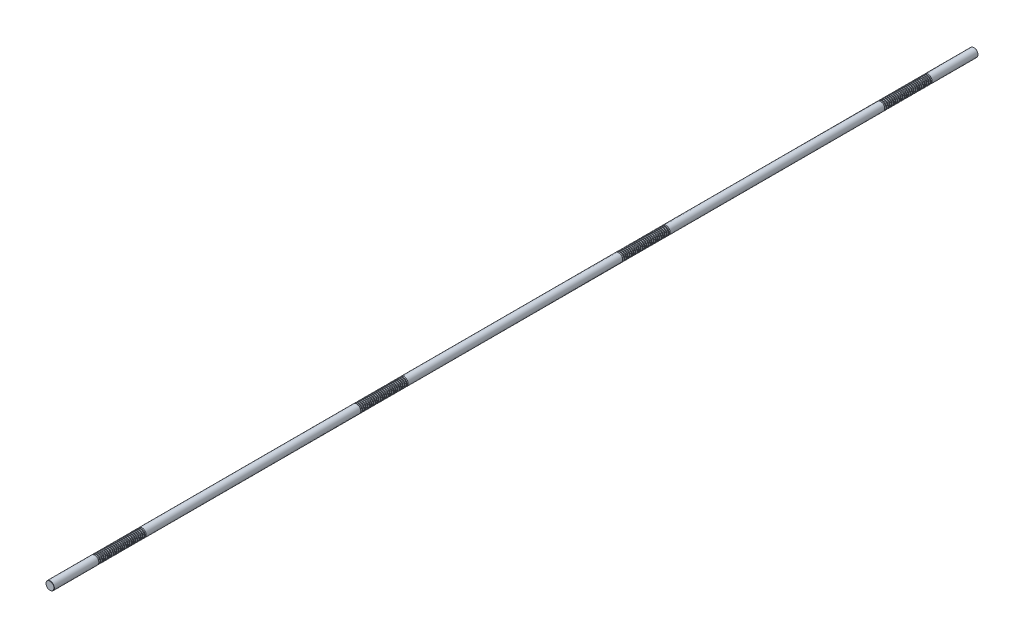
from build123d import *

# Parameters (mm, degrees)
SKETCH1_R           = 9
BOSS_EXTRUDE1_DEPTH = 1000
CHAMFER1_SIZE       = 0.45
LPATTERN1_COUNT     = 26
LPATTERN1_PITCH     = 4
LPATTERN2_COUNT     = 4
LPATTERN2_PITCH     = 567


with BuildPart() as part:
    # Sketch1 → Boss-Extrude1 (new, symmetric)
    with BuildSketch(Plane.XY):
        Circle(SKETCH1_R)
    extrude(amount=BOSS_EXTRUDE1_DEPTH, both=True)

    # Chamfer1
    chamfer1_edges = [part.edges().sort_by_distance(p)[0] for p in [
        (-9, 0, -1000),
        (-9, 0, 1000),
    ]]
    chamfer(chamfer1_edges, length=CHAMFER1_SIZE)

    # Sketch2 → Cut-Revolve1 (revolve, cut)
    with BuildSketch(Plane(origin=(0, 0, 0), x_dir=(0, 0, -1), z_dir=(1, 0, 0)), mode=Mode.PRIVATE) as cut_revolve1_sk:
        Polygon((900.301442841, 9), (897.698557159, 9), (898.301442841, 6.75), (899.698557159, 6.75), align=None)
    cut_revolve1 = revolve(cut_revolve1_sk.sketch.rotate(Axis((0, 0, 1000), (0, 0, -1)), 90), axis=Axis((0, 0, 1000), (0, 0, -1)), mode=Mode.SUBTRACT)

    # LPattern1: Cut-Revolve1 ×26
    with Locations(*[(0, 0, i * LPATTERN1_PITCH) for i in range(1, LPATTERN1_COUNT)]):
        add(cut_revolve1, mode=Mode.SUBTRACT)

    # LPattern2: Cut-Revolve1 ×4
    with Locations(*[(0, 0, i * LPATTERN2_PITCH) for i in range(1, LPATTERN2_COUNT)]):
        add(cut_revolve1, mode=Mode.SUBTRACT)

    # LPattern2 copy 1 sketch → LPattern2 copy 1 (revolve, cut)
    with BuildSketch(Plane(origin=(0, 0, 571), x_dir=(0, 0, -1), z_dir=(1, 0, 0))):
        Polygon((900.301442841, 9), (897.698557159, 9), (898.301442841, 6.75), (899.698557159, 6.75), align=None)
    revolve(axis=Axis((0, 0, 1571), (0, 0, -1)), mode=Mode.SUBTRACT)

    # LPattern2 copy 2 sketch → LPattern2 copy 2 (revolve, cut)
    with BuildSketch(Plane(origin=(0, 0, 1138), x_dir=(0, 0, -1), z_dir=(1, 0, 0))):
        Polygon((900.301442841, 9), (897.698557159, 9), (898.301442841, 6.75), (899.698557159, 6.75), align=None)
    revolve(axis=Axis((0, 0, 2138), (0, 0, -1)), mode=Mode.SUBTRACT)

    # LPattern2 copy 3 sketch → LPattern2 copy 3 (revolve, cut)
    with BuildSketch(Plane(origin=(0, 0, 1705), x_dir=(0, 0, -1), z_dir=(1, 0, 0))):
        Polygon((900.301442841, 9), (897.698557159, 9), (898.301442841, 6.75), (899.698557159, 6.75), align=None)
    revolve(axis=Axis((0, 0, 2705), (0, 0, -1)), mode=Mode.SUBTRACT)

    # LPattern2 copy 4 sketch → LPattern2 copy 4 (revolve, cut)
    with BuildSketch(Plane(origin=(0, 0, 575), x_dir=(0, 0, -1), z_dir=(1, 0, 0))):
        Polygon((900.301442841, 9), (897.698557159, 9), (898.301442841, 6.75), (899.698557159, 6.75), align=None)
    revolve(axis=Axis((0, 0, 1575), (0, 0, -1)), mode=Mode.SUBTRACT)

    # LPattern2 copy 5 sketch → LPattern2 copy 5 (revolve, cut)
    with BuildSketch(Plane(origin=(0, 0, 1142), x_dir=(0, 0, -1), z_dir=(1, 0, 0))):
        Polygon((900.301442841, 9), (897.698557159, 9), (898.301442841, 6.75), (899.698557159, 6.75), align=None)
    revolve(axis=Axis((0, 0, 2142), (0, 0, -1)), mode=Mode.SUBTRACT)

    # LPattern2 copy 6 sketch → LPattern2 copy 6 (revolve, cut)
    with BuildSketch(Plane(origin=(0, 0, 1709), x_dir=(0, 0, -1), z_dir=(1, 0, 0))):
        Polygon((900.301442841, 9), (897.698557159, 9), (898.301442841, 6.75), (899.698557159, 6.75), align=None)
    revolve(axis=Axis((0, 0, 2709), (0, 0, -1)), mode=Mode.SUBTRACT)

    # LPattern2 copy 7 sketch → LPattern2 copy 7 (revolve, cut)
    with BuildSketch(Plane(origin=(0, 0, 579), x_dir=(0, 0, -1), z_dir=(1, 0, 0))):
        Polygon((900.301442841, 9), (897.698557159, 9), (898.301442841, 6.75), (899.698557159, 6.75), align=None)
    revolve(axis=Axis((0, 0, 1579), (0, 0, -1)), mode=Mode.SUBTRACT)

    # LPattern2 copy 8 sketch → LPattern2 copy 8 (revolve, cut)
    with BuildSketch(Plane(origin=(0, 0, 1146), x_dir=(0, 0, -1), z_dir=(1, 0, 0))):
        Polygon((900.301442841, 9), (897.698557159, 9), (898.301442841, 6.75), (899.698557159, 6.75), align=None)
    revolve(axis=Axis((0, 0, 2146), (0, 0, -1)), mode=Mode.SUBTRACT)

    # LPattern2 copy 9 sketch → LPattern2 copy 9 (revolve, cut)
    with BuildSketch(Plane(origin=(0, 0, 1713), x_dir=(0, 0, -1), z_dir=(1, 0, 0))):
        Polygon((900.301442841, 9), (897.698557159, 9), (898.301442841, 6.75), (899.698557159, 6.75), align=None)
    revolve(axis=Axis((0, 0, 2713), (0, 0, -1)), mode=Mode.SUBTRACT)

    # LPattern2 copy 10 sketch → LPattern2 copy 10 (revolve, cut)
    with BuildSketch(Plane(origin=(0, 0, 583), x_dir=(0, 0, -1), z_dir=(1, 0, 0))):
        Polygon((900.301442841, 9), (897.698557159, 9), (898.301442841, 6.75), (899.698557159, 6.75), align=None)
    revolve(axis=Axis((0, 0, 1583), (0, 0, -1)), mode=Mode.SUBTRACT)

    # LPattern2 copy 11 sketch → LPattern2 copy 11 (revolve, cut)
    with BuildSketch(Plane(origin=(0, 0, 1150), x_dir=(0, 0, -1), z_dir=(1, 0, 0))):
        Polygon((900.301442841, 9), (897.698557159, 9), (898.301442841, 6.75), (899.698557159, 6.75), align=None)
    revolve(axis=Axis((0, 0, 2150), (0, 0, -1)), mode=Mode.SUBTRACT)

    # LPattern2 copy 12 sketch → LPattern2 copy 12 (revolve, cut)
    with BuildSketch(Plane(origin=(0, 0, 1717), x_dir=(0, 0, -1), z_dir=(1, 0, 0))):
        Polygon((900.301442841, 9), (897.698557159, 9), (898.301442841, 6.75), (899.698557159, 6.75), align=None)
    revolve(axis=Axis((0, 0, 2717), (0, 0, -1)), mode=Mode.SUBTRACT)

    # LPattern2 copy 13 sketch → LPattern2 copy 13 (revolve, cut)
    with BuildSketch(Plane(origin=(0, 0, 587), x_dir=(0, 0, -1), z_dir=(1, 0, 0))):
        Polygon((900.301442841, 9), (897.698557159, 9), (898.301442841, 6.75), (899.698557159, 6.75), align=None)
    revolve(axis=Axis((0, 0, 1587), (0, 0, -1)), mode=Mode.SUBTRACT)

    # LPattern2 copy 14 sketch → LPattern2 copy 14 (revolve, cut)
    with BuildSketch(Plane(origin=(0, 0, 1154), x_dir=(0, 0, -1), z_dir=(1, 0, 0))):
        Polygon((900.301442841, 9), (897.698557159, 9), (898.301442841, 6.75), (899.698557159, 6.75), align=None)
    revolve(axis=Axis((0, 0, 2154), (0, 0, -1)), mode=Mode.SUBTRACT)

    # LPattern2 copy 15 sketch → LPattern2 copy 15 (revolve, cut)
    with BuildSketch(Plane(origin=(0, 0, 1721), x_dir=(0, 0, -1), z_dir=(1, 0, 0))):
        Polygon((900.301442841, 9), (897.698557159, 9), (898.301442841, 6.75), (899.698557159, 6.75), align=None)
    revolve(axis=Axis((0, 0, 2721), (0, 0, -1)), mode=Mode.SUBTRACT)

    # LPattern2 copy 16 sketch → LPattern2 copy 16 (revolve, cut)
    with BuildSketch(Plane(origin=(0, 0, 591), x_dir=(0, 0, -1), z_dir=(1, 0, 0))):
        Polygon((900.301442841, 9), (897.698557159, 9), (898.301442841, 6.75), (899.698557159, 6.75), align=None)
    revolve(axis=Axis((0, 0, 1591), (0, 0, -1)), mode=Mode.SUBTRACT)

    # LPattern2 copy 17 sketch → LPattern2 copy 17 (revolve, cut)
    with BuildSketch(Plane(origin=(0, 0, 1158), x_dir=(0, 0, -1), z_dir=(1, 0, 0))):
        Polygon((900.301442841, 9), (897.698557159, 9), (898.301442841, 6.75), (899.698557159, 6.75), align=None)
    revolve(axis=Axis((0, 0, 2158), (0, 0, -1)), mode=Mode.SUBTRACT)

    # LPattern2 copy 18 sketch → LPattern2 copy 18 (revolve, cut)
    with BuildSketch(Plane(origin=(0, 0, 1725), x_dir=(0, 0, -1), z_dir=(1, 0, 0))):
        Polygon((900.301442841, 9), (897.698557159, 9), (898.301442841, 6.75), (899.698557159, 6.75), align=None)
    revolve(axis=Axis((0, 0, 2725), (0, 0, -1)), mode=Mode.SUBTRACT)

    # LPattern2 copy 19 sketch → LPattern2 copy 19 (revolve, cut)
    with BuildSketch(Plane(origin=(0, 0, 595), x_dir=(0, 0, -1), z_dir=(1, 0, 0))):
        Polygon((900.301442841, 9), (897.698557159, 9), (898.301442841, 6.75), (899.698557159, 6.75), align=None)
    revolve(axis=Axis((0, 0, 1595), (0, 0, -1)), mode=Mode.SUBTRACT)

    # LPattern2 copy 20 sketch → LPattern2 copy 20 (revolve, cut)
    with BuildSketch(Plane(origin=(0, 0, 1162), x_dir=(0, 0, -1), z_dir=(1, 0, 0))):
        Polygon((900.301442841, 9), (897.698557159, 9), (898.301442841, 6.75), (899.698557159, 6.75), align=None)
    revolve(axis=Axis((0, 0, 2162), (0, 0, -1)), mode=Mode.SUBTRACT)

    # LPattern2 copy 21 sketch → LPattern2 copy 21 (revolve, cut)
    with BuildSketch(Plane(origin=(0, 0, 1729), x_dir=(0, 0, -1), z_dir=(1, 0, 0))):
        Polygon((900.301442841, 9), (897.698557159, 9), (898.301442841, 6.75), (899.698557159, 6.75), align=None)
    revolve(axis=Axis((0, 0, 2729), (0, 0, -1)), mode=Mode.SUBTRACT)

    # LPattern2 copy 22 sketch → LPattern2 copy 22 (revolve, cut)
    with BuildSketch(Plane(origin=(0, 0, 599), x_dir=(0, 0, -1), z_dir=(1, 0, 0))):
        Polygon((900.301442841, 9), (897.698557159, 9), (898.301442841, 6.75), (899.698557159, 6.75), align=None)
    revolve(axis=Axis((0, 0, 1599), (0, 0, -1)), mode=Mode.SUBTRACT)

    # LPattern2 copy 23 sketch → LPattern2 copy 23 (revolve, cut)
    with BuildSketch(Plane(origin=(0, 0, 1166), x_dir=(0, 0, -1), z_dir=(1, 0, 0))):
        Polygon((900.301442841, 9), (897.698557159, 9), (898.301442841, 6.75), (899.698557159, 6.75), align=None)
    revolve(axis=Axis((0, 0, 2166), (0, 0, -1)), mode=Mode.SUBTRACT)

    # LPattern2 copy 24 sketch → LPattern2 copy 24 (revolve, cut)
    with BuildSketch(Plane(origin=(0, 0, 1733), x_dir=(0, 0, -1), z_dir=(1, 0, 0))):
        Polygon((900.301442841, 9), (897.698557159, 9), (898.301442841, 6.75), (899.698557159, 6.75), align=None)
    revolve(axis=Axis((0, 0, 2733), (0, 0, -1)), mode=Mode.SUBTRACT)

    # LPattern2 copy 25 sketch → LPattern2 copy 25 (revolve, cut)
    with BuildSketch(Plane(origin=(0, 0, 603), x_dir=(0, 0, -1), z_dir=(1, 0, 0))):
        Polygon((900.301442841, 9), (897.698557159, 9), (898.301442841, 6.75), (899.698557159, 6.75), align=None)
    revolve(axis=Axis((0, 0, 1603), (0, 0, -1)), mode=Mode.SUBTRACT)

    # LPattern2 copy 26 sketch → LPattern2 copy 26 (revolve, cut)
    with BuildSketch(Plane(origin=(0, 0, 1170), x_dir=(0, 0, -1), z_dir=(1, 0, 0))):
        Polygon((900.301442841, 9), (897.698557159, 9), (898.301442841, 6.75), (899.698557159, 6.75), align=None)
    revolve(axis=Axis((0, 0, 2170), (0, 0, -1)), mode=Mode.SUBTRACT)

    # LPattern2 copy 27 sketch → LPattern2 copy 27 (revolve, cut)
    with BuildSketch(Plane(origin=(0, 0, 1737), x_dir=(0, 0, -1), z_dir=(1, 0, 0))):
        Polygon((900.301442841, 9), (897.698557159, 9), (898.301442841, 6.75), (899.698557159, 6.75), align=None)
    revolve(axis=Axis((0, 0, 2737), (0, 0, -1)), mode=Mode.SUBTRACT)

    # LPattern2 copy 28 sketch → LPattern2 copy 28 (revolve, cut)
    with BuildSketch(Plane(origin=(0, 0, 607), x_dir=(0, 0, -1), z_dir=(1, 0, 0))):
        Polygon((900.301442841, 9), (897.698557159, 9), (898.301442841, 6.75), (899.698557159, 6.75), align=None)
    revolve(axis=Axis((0, 0, 1607), (0, 0, -1)), mode=Mode.SUBTRACT)

    # LPattern2 copy 29 sketch → LPattern2 copy 29 (revolve, cut)
    with BuildSketch(Plane(origin=(0, 0, 1174), x_dir=(0, 0, -1), z_dir=(1, 0, 0))):
        Polygon((900.301442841, 9), (897.698557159, 9), (898.301442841, 6.75), (899.698557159, 6.75), align=None)
    revolve(axis=Axis((0, 0, 2174), (0, 0, -1)), mode=Mode.SUBTRACT)

    # LPattern2 copy 30 sketch → LPattern2 copy 30 (revolve, cut)
    with BuildSketch(Plane(origin=(0, 0, 1741), x_dir=(0, 0, -1), z_dir=(1, 0, 0))):
        Polygon((900.301442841, 9), (897.698557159, 9), (898.301442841, 6.75), (899.698557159, 6.75), align=None)
    revolve(axis=Axis((0, 0, 2741), (0, 0, -1)), mode=Mode.SUBTRACT)

    # LPattern2 copy 31 sketch → LPattern2 copy 31 (revolve, cut)
    with BuildSketch(Plane(origin=(0, 0, 611), x_dir=(0, 0, -1), z_dir=(1, 0, 0))):
        Polygon((900.301442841, 9), (897.698557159, 9), (898.301442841, 6.75), (899.698557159, 6.75), align=None)
    revolve(axis=Axis((0, 0, 1611), (0, 0, -1)), mode=Mode.SUBTRACT)

    # LPattern2 copy 32 sketch → LPattern2 copy 32 (revolve, cut)
    with BuildSketch(Plane(origin=(0, 0, 1178), x_dir=(0, 0, -1), z_dir=(1, 0, 0))):
        Polygon((900.301442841, 9), (897.698557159, 9), (898.301442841, 6.75), (899.698557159, 6.75), align=None)
    revolve(axis=Axis((0, 0, 2178), (0, 0, -1)), mode=Mode.SUBTRACT)

    # LPattern2 copy 33 sketch → LPattern2 copy 33 (revolve, cut)
    with BuildSketch(Plane(origin=(0, 0, 1745), x_dir=(0, 0, -1), z_dir=(1, 0, 0))):
        Polygon((900.301442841, 9), (897.698557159, 9), (898.301442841, 6.75), (899.698557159, 6.75), align=None)
    revolve(axis=Axis((0, 0, 2745), (0, 0, -1)), mode=Mode.SUBTRACT)

    # LPattern2 copy 34 sketch → LPattern2 copy 34 (revolve, cut)
    with BuildSketch(Plane(origin=(0, 0, 615), x_dir=(0, 0, -1), z_dir=(1, 0, 0))):
        Polygon((900.301442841, 9), (897.698557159, 9), (898.301442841, 6.75), (899.698557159, 6.75), align=None)
    revolve(axis=Axis((0, 0, 1615), (0, 0, -1)), mode=Mode.SUBTRACT)

    # LPattern2 copy 35 sketch → LPattern2 copy 35 (revolve, cut)
    with BuildSketch(Plane(origin=(0, 0, 1182), x_dir=(0, 0, -1), z_dir=(1, 0, 0))):
        Polygon((900.301442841, 9), (897.698557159, 9), (898.301442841, 6.75), (899.698557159, 6.75), align=None)
    revolve(axis=Axis((0, 0, 2182), (0, 0, -1)), mode=Mode.SUBTRACT)

    # LPattern2 copy 36 sketch → LPattern2 copy 36 (revolve, cut)
    with BuildSketch(Plane(origin=(0, 0, 1749), x_dir=(0, 0, -1), z_dir=(1, 0, 0))):
        Polygon((900.301442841, 9), (897.698557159, 9), (898.301442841, 6.75), (899.698557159, 6.75), align=None)
    revolve(axis=Axis((0, 0, 2749), (0, 0, -1)), mode=Mode.SUBTRACT)

    # LPattern2 copy 37 sketch → LPattern2 copy 37 (revolve, cut)
    with BuildSketch(Plane(origin=(0, 0, 619), x_dir=(0, 0, -1), z_dir=(1, 0, 0))):
        Polygon((900.301442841, 9), (897.698557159, 9), (898.301442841, 6.75), (899.698557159, 6.75), align=None)
    revolve(axis=Axis((0, 0, 1619), (0, 0, -1)), mode=Mode.SUBTRACT)

    # LPattern2 copy 38 sketch → LPattern2 copy 38 (revolve, cut)
    with BuildSketch(Plane(origin=(0, 0, 1186), x_dir=(0, 0, -1), z_dir=(1, 0, 0))):
        Polygon((900.301442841, 9), (897.698557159, 9), (898.301442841, 6.75), (899.698557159, 6.75), align=None)
    revolve(axis=Axis((0, 0, 2186), (0, 0, -1)), mode=Mode.SUBTRACT)

    # LPattern2 copy 39 sketch → LPattern2 copy 39 (revolve, cut)
    with BuildSketch(Plane(origin=(0, 0, 1753), x_dir=(0, 0, -1), z_dir=(1, 0, 0))):
        Polygon((900.301442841, 9), (897.698557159, 9), (898.301442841, 6.75), (899.698557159, 6.75), align=None)
    revolve(axis=Axis((0, 0, 2753), (0, 0, -1)), mode=Mode.SUBTRACT)

    # LPattern2 copy 40 sketch → LPattern2 copy 40 (revolve, cut)
    with BuildSketch(Plane(origin=(0, 0, 623), x_dir=(0, 0, -1), z_dir=(1, 0, 0))):
        Polygon((900.301442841, 9), (897.698557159, 9), (898.301442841, 6.75), (899.698557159, 6.75), align=None)
    revolve(axis=Axis((0, 0, 1623), (0, 0, -1)), mode=Mode.SUBTRACT)

    # LPattern2 copy 41 sketch → LPattern2 copy 41 (revolve, cut)
    with BuildSketch(Plane(origin=(0, 0, 1190), x_dir=(0, 0, -1), z_dir=(1, 0, 0))):
        Polygon((900.301442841, 9), (897.698557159, 9), (898.301442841, 6.75), (899.698557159, 6.75), align=None)
    revolve(axis=Axis((0, 0, 2190), (0, 0, -1)), mode=Mode.SUBTRACT)

    # LPattern2 copy 42 sketch → LPattern2 copy 42 (revolve, cut)
    with BuildSketch(Plane(origin=(0, 0, 1757), x_dir=(0, 0, -1), z_dir=(1, 0, 0))):
        Polygon((900.301442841, 9), (897.698557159, 9), (898.301442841, 6.75), (899.698557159, 6.75), align=None)
    revolve(axis=Axis((0, 0, 2757), (0, 0, -1)), mode=Mode.SUBTRACT)

    # LPattern2 copy 43 sketch → LPattern2 copy 43 (revolve, cut)
    with BuildSketch(Plane(origin=(0, 0, 627), x_dir=(0, 0, -1), z_dir=(1, 0, 0))):
        Polygon((900.301442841, 9), (897.698557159, 9), (898.301442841, 6.75), (899.698557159, 6.75), align=None)
    revolve(axis=Axis((0, 0, 1627), (0, 0, -1)), mode=Mode.SUBTRACT)

    # LPattern2 copy 44 sketch → LPattern2 copy 44 (revolve, cut)
    with BuildSketch(Plane(origin=(0, 0, 1194), x_dir=(0, 0, -1), z_dir=(1, 0, 0))):
        Polygon((900.301442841, 9), (897.698557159, 9), (898.301442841, 6.75), (899.698557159, 6.75), align=None)
    revolve(axis=Axis((0, 0, 2194), (0, 0, -1)), mode=Mode.SUBTRACT)

    # LPattern2 copy 45 sketch → LPattern2 copy 45 (revolve, cut)
    with BuildSketch(Plane(origin=(0, 0, 1761), x_dir=(0, 0, -1), z_dir=(1, 0, 0))):
        Polygon((900.301442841, 9), (897.698557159, 9), (898.301442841, 6.75), (899.698557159, 6.75), align=None)
    revolve(axis=Axis((0, 0, 2761), (0, 0, -1)), mode=Mode.SUBTRACT)

    # LPattern2 copy 46 sketch → LPattern2 copy 46 (revolve, cut)
    with BuildSketch(Plane(origin=(0, 0, 631), x_dir=(0, 0, -1), z_dir=(1, 0, 0))):
        Polygon((900.301442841, 9), (897.698557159, 9), (898.301442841, 6.75), (899.698557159, 6.75), align=None)
    revolve(axis=Axis((0, 0, 1631), (0, 0, -1)), mode=Mode.SUBTRACT)

    # LPattern2 copy 47 sketch → LPattern2 copy 47 (revolve, cut)
    with BuildSketch(Plane(origin=(0, 0, 1198), x_dir=(0, 0, -1), z_dir=(1, 0, 0))):
        Polygon((900.301442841, 9), (897.698557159, 9), (898.301442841, 6.75), (899.698557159, 6.75), align=None)
    revolve(axis=Axis((0, 0, 2198), (0, 0, -1)), mode=Mode.SUBTRACT)

    # LPattern2 copy 48 sketch → LPattern2 copy 48 (revolve, cut)
    with BuildSketch(Plane(origin=(0, 0, 1765), x_dir=(0, 0, -1), z_dir=(1, 0, 0))):
        Polygon((900.301442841, 9), (897.698557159, 9), (898.301442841, 6.75), (899.698557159, 6.75), align=None)
    revolve(axis=Axis((0, 0, 2765), (0, 0, -1)), mode=Mode.SUBTRACT)

    # LPattern2 copy 49 sketch → LPattern2 copy 49 (revolve, cut)
    with BuildSketch(Plane(origin=(0, 0, 635), x_dir=(0, 0, -1), z_dir=(1, 0, 0))):
        Polygon((900.301442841, 9), (897.698557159, 9), (898.301442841, 6.75), (899.698557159, 6.75), align=None)
    revolve(axis=Axis((0, 0, 1635), (0, 0, -1)), mode=Mode.SUBTRACT)

    # LPattern2 copy 50 sketch → LPattern2 copy 50 (revolve, cut)
    with BuildSketch(Plane(origin=(0, 0, 1202), x_dir=(0, 0, -1), z_dir=(1, 0, 0))):
        Polygon((900.301442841, 9), (897.698557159, 9), (898.301442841, 6.75), (899.698557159, 6.75), align=None)
    revolve(axis=Axis((0, 0, 2202), (0, 0, -1)), mode=Mode.SUBTRACT)

    # LPattern2 copy 51 sketch → LPattern2 copy 51 (revolve, cut)
    with BuildSketch(Plane(origin=(0, 0, 1769), x_dir=(0, 0, -1), z_dir=(1, 0, 0))):
        Polygon((900.301442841, 9), (897.698557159, 9), (898.301442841, 6.75), (899.698557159, 6.75), align=None)
    revolve(axis=Axis((0, 0, 2769), (0, 0, -1)), mode=Mode.SUBTRACT)

    # LPattern2 copy 52 sketch → LPattern2 copy 52 (revolve, cut)
    with BuildSketch(Plane(origin=(0, 0, 639), x_dir=(0, 0, -1), z_dir=(1, 0, 0))):
        Polygon((900.301442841, 9), (897.698557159, 9), (898.301442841, 6.75), (899.698557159, 6.75), align=None)
    revolve(axis=Axis((0, 0, 1639), (0, 0, -1)), mode=Mode.SUBTRACT)

    # LPattern2 copy 53 sketch → LPattern2 copy 53 (revolve, cut)
    with BuildSketch(Plane(origin=(0, 0, 1206), x_dir=(0, 0, -1), z_dir=(1, 0, 0))):
        Polygon((900.301442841, 9), (897.698557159, 9), (898.301442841, 6.75), (899.698557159, 6.75), align=None)
    revolve(axis=Axis((0, 0, 2206), (0, 0, -1)), mode=Mode.SUBTRACT)

    # LPattern2 copy 54 sketch → LPattern2 copy 54 (revolve, cut)
    with BuildSketch(Plane(origin=(0, 0, 1773), x_dir=(0, 0, -1), z_dir=(1, 0, 0))):
        Polygon((900.301442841, 9), (897.698557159, 9), (898.301442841, 6.75), (899.698557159, 6.75), align=None)
    revolve(axis=Axis((0, 0, 2773), (0, 0, -1)), mode=Mode.SUBTRACT)

    # LPattern2 copy 55 sketch → LPattern2 copy 55 (revolve, cut)
    with BuildSketch(Plane(origin=(0, 0, 643), x_dir=(0, 0, -1), z_dir=(1, 0, 0))):
        Polygon((900.301442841, 9), (897.698557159, 9), (898.301442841, 6.75), (899.698557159, 6.75), align=None)
    revolve(axis=Axis((0, 0, 1643), (0, 0, -1)), mode=Mode.SUBTRACT)

    # LPattern2 copy 56 sketch → LPattern2 copy 56 (revolve, cut)
    with BuildSketch(Plane(origin=(0, 0, 1210), x_dir=(0, 0, -1), z_dir=(1, 0, 0))):
        Polygon((900.301442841, 9), (897.698557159, 9), (898.301442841, 6.75), (899.698557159, 6.75), align=None)
    revolve(axis=Axis((0, 0, 2210), (0, 0, -1)), mode=Mode.SUBTRACT)

    # LPattern2 copy 57 sketch → LPattern2 copy 57 (revolve, cut)
    with BuildSketch(Plane(origin=(0, 0, 1777), x_dir=(0, 0, -1), z_dir=(1, 0, 0))):
        Polygon((900.301442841, 9), (897.698557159, 9), (898.301442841, 6.75), (899.698557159, 6.75), align=None)
    revolve(axis=Axis((0, 0, 2777), (0, 0, -1)), mode=Mode.SUBTRACT)

    # LPattern2 copy 58 sketch → LPattern2 copy 58 (revolve, cut)
    with BuildSketch(Plane(origin=(0, 0, 647), x_dir=(0, 0, -1), z_dir=(1, 0, 0))):
        Polygon((900.301442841, 9), (897.698557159, 9), (898.301442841, 6.75), (899.698557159, 6.75), align=None)
    revolve(axis=Axis((0, 0, 1647), (0, 0, -1)), mode=Mode.SUBTRACT)

    # LPattern2 copy 59 sketch → LPattern2 copy 59 (revolve, cut)
    with BuildSketch(Plane(origin=(0, 0, 1214), x_dir=(0, 0, -1), z_dir=(1, 0, 0))):
        Polygon((900.301442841, 9), (897.698557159, 9), (898.301442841, 6.75), (899.698557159, 6.75), align=None)
    revolve(axis=Axis((0, 0, 2214), (0, 0, -1)), mode=Mode.SUBTRACT)

    # LPattern2 copy 60 sketch → LPattern2 copy 60 (revolve, cut)
    with BuildSketch(Plane(origin=(0, 0, 1781), x_dir=(0, 0, -1), z_dir=(1, 0, 0))):
        Polygon((900.301442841, 9), (897.698557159, 9), (898.301442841, 6.75), (899.698557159, 6.75), align=None)
    revolve(axis=Axis((0, 0, 2781), (0, 0, -1)), mode=Mode.SUBTRACT)

    # LPattern2 copy 61 sketch → LPattern2 copy 61 (revolve, cut)
    with BuildSketch(Plane(origin=(0, 0, 651), x_dir=(0, 0, -1), z_dir=(1, 0, 0))):
        Polygon((900.301442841, 9), (897.698557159, 9), (898.301442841, 6.75), (899.698557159, 6.75), align=None)
    revolve(axis=Axis((0, 0, 1651), (0, 0, -1)), mode=Mode.SUBTRACT)

    # LPattern2 copy 62 sketch → LPattern2 copy 62 (revolve, cut)
    with BuildSketch(Plane(origin=(0, 0, 1218), x_dir=(0, 0, -1), z_dir=(1, 0, 0))):
        Polygon((900.301442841, 9), (897.698557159, 9), (898.301442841, 6.75), (899.698557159, 6.75), align=None)
    revolve(axis=Axis((0, 0, 2218), (0, 0, -1)), mode=Mode.SUBTRACT)

    # LPattern2 copy 63 sketch → LPattern2 copy 63 (revolve, cut)
    with BuildSketch(Plane(origin=(0, 0, 1785), x_dir=(0, 0, -1), z_dir=(1, 0, 0))):
        Polygon((900.301442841, 9), (897.698557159, 9), (898.301442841, 6.75), (899.698557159, 6.75), align=None)
    revolve(axis=Axis((0, 0, 2785), (0, 0, -1)), mode=Mode.SUBTRACT)

    # LPattern2 copy 64 sketch → LPattern2 copy 64 (revolve, cut)
    with BuildSketch(Plane(origin=(0, 0, 655), x_dir=(0, 0, -1), z_dir=(1, 0, 0))):
        Polygon((900.301442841, 9), (897.698557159, 9), (898.301442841, 6.75), (899.698557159, 6.75), align=None)
    revolve(axis=Axis((0, 0, 1655), (0, 0, -1)), mode=Mode.SUBTRACT)

    # LPattern2 copy 65 sketch → LPattern2 copy 65 (revolve, cut)
    with BuildSketch(Plane(origin=(0, 0, 1222), x_dir=(0, 0, -1), z_dir=(1, 0, 0))):
        Polygon((900.301442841, 9), (897.698557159, 9), (898.301442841, 6.75), (899.698557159, 6.75), align=None)
    revolve(axis=Axis((0, 0, 2222), (0, 0, -1)), mode=Mode.SUBTRACT)

    # LPattern2 copy 66 sketch → LPattern2 copy 66 (revolve, cut)
    with BuildSketch(Plane(origin=(0, 0, 1789), x_dir=(0, 0, -1), z_dir=(1, 0, 0))):
        Polygon((900.301442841, 9), (897.698557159, 9), (898.301442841, 6.75), (899.698557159, 6.75), align=None)
    revolve(axis=Axis((0, 0, 2789), (0, 0, -1)), mode=Mode.SUBTRACT)

    # LPattern2 copy 67 sketch → LPattern2 copy 67 (revolve, cut)
    with BuildSketch(Plane(origin=(0, 0, 659), x_dir=(0, 0, -1), z_dir=(1, 0, 0))):
        Polygon((900.301442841, 9), (897.698557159, 9), (898.301442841, 6.75), (899.698557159, 6.75), align=None)
    revolve(axis=Axis((0, 0, 1659), (0, 0, -1)), mode=Mode.SUBTRACT)

    # LPattern2 copy 68 sketch → LPattern2 copy 68 (revolve, cut)
    with BuildSketch(Plane(origin=(0, 0, 1226), x_dir=(0, 0, -1), z_dir=(1, 0, 0))):
        Polygon((900.301442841, 9), (897.698557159, 9), (898.301442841, 6.75), (899.698557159, 6.75), align=None)
    revolve(axis=Axis((0, 0, 2226), (0, 0, -1)), mode=Mode.SUBTRACT)

    # LPattern2 copy 69 sketch → LPattern2 copy 69 (revolve, cut)
    with BuildSketch(Plane(origin=(0, 0, 1793), x_dir=(0, 0, -1), z_dir=(1, 0, 0))):
        Polygon((900.301442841, 9), (897.698557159, 9), (898.301442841, 6.75), (899.698557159, 6.75), align=None)
    revolve(axis=Axis((0, 0, 2793), (0, 0, -1)), mode=Mode.SUBTRACT)

    # LPattern2 copy 70 sketch → LPattern2 copy 70 (revolve, cut)
    with BuildSketch(Plane(origin=(0, 0, 663), x_dir=(0, 0, -1), z_dir=(1, 0, 0))):
        Polygon((900.301442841, 9), (897.698557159, 9), (898.301442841, 6.75), (899.698557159, 6.75), align=None)
    revolve(axis=Axis((0, 0, 1663), (0, 0, -1)), mode=Mode.SUBTRACT)

    # LPattern2 copy 71 sketch → LPattern2 copy 71 (revolve, cut)
    with BuildSketch(Plane(origin=(0, 0, 1230), x_dir=(0, 0, -1), z_dir=(1, 0, 0))):
        Polygon((900.301442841, 9), (897.698557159, 9), (898.301442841, 6.75), (899.698557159, 6.75), align=None)
    revolve(axis=Axis((0, 0, 2230), (0, 0, -1)), mode=Mode.SUBTRACT)

    # LPattern2 copy 72 sketch → LPattern2 copy 72 (revolve, cut)
    with BuildSketch(Plane(origin=(0, 0, 1797), x_dir=(0, 0, -1), z_dir=(1, 0, 0))):
        Polygon((900.301442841, 9), (897.698557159, 9), (898.301442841, 6.75), (899.698557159, 6.75), align=None)
    revolve(axis=Axis((0, 0, 2797), (0, 0, -1)), mode=Mode.SUBTRACT)

    # LPattern2 copy 73 sketch → LPattern2 copy 73 (revolve, cut)
    with BuildSketch(Plane(origin=(0, 0, 667), x_dir=(0, 0, -1), z_dir=(1, 0, 0))):
        Polygon((900.301442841, 9), (897.698557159, 9), (898.301442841, 6.75), (899.698557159, 6.75), align=None)
    revolve(axis=Axis((0, 0, 1667), (0, 0, -1)), mode=Mode.SUBTRACT)

    # LPattern2 copy 74 sketch → LPattern2 copy 74 (revolve, cut)
    with BuildSketch(Plane(origin=(0, 0, 1234), x_dir=(0, 0, -1), z_dir=(1, 0, 0))):
        Polygon((900.301442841, 9), (897.698557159, 9), (898.301442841, 6.75), (899.698557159, 6.75), align=None)
    revolve(axis=Axis((0, 0, 2234), (0, 0, -1)), mode=Mode.SUBTRACT)

    # LPattern2 copy 75 sketch → LPattern2 copy 75 (revolve, cut)
    with BuildSketch(Plane(origin=(0, 0, 1801), x_dir=(0, 0, -1), z_dir=(1, 0, 0))):
        Polygon((900.301442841, 9), (897.698557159, 9), (898.301442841, 6.75), (899.698557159, 6.75), align=None)
    revolve(axis=Axis((0, 0, 2801), (0, 0, -1)), mode=Mode.SUBTRACT)


solid = part.part
